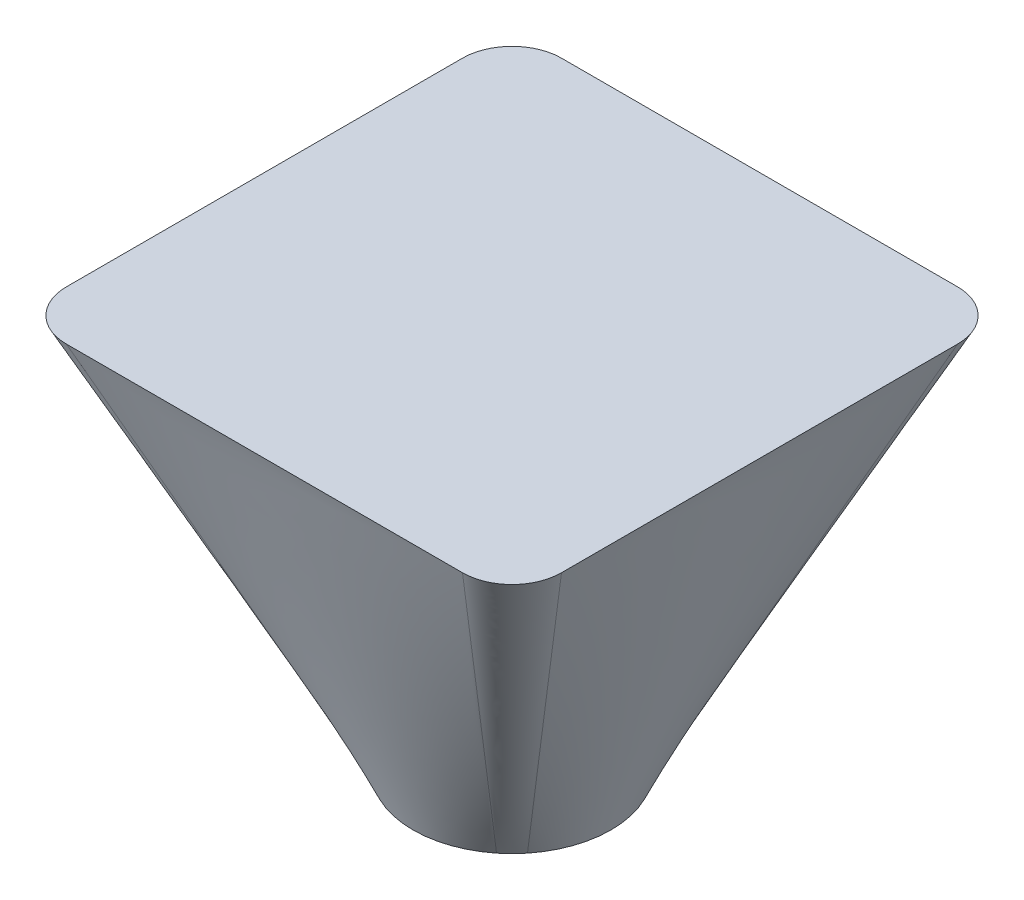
from build123d import *


with BuildPart() as part:
    # Skizze2 for Ausformung1 → Ausformung1 section 0
    with BuildSketch(Plane(origin=(0, -80, 0), x_dir=(-1, 0, 0), z_dir=(0, 1, 0))):
        with BuildLine():
            # circular arc as an exact rational Bezier (weights 1, cos(half-angle), 1)
            Bezier((-15.617376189, 12.493900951), (-25.61249695, 0), (-15.617376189, -12.493900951), weights=[1, 0.780868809, 1])
            Bezier((-15.617376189, -12.493900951), (-14.229164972, -14.229164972), (-12.493900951, -15.617376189), weights=[1, 0.993883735, 1])
            Bezier((-12.493900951, -15.617376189), (0, -25.61249695), (12.493900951, -15.617376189), weights=[1, 0.780868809, 1])
            Bezier((12.493900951, -15.617376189), (14.229164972, -14.229164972), (15.617376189, -12.493900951), weights=[1, 0.993883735, 1])
            Bezier((15.617376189, -12.493900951), (25.61249695, 0), (15.617376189, 12.493900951), weights=[1, 0.780868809, 1])
            Bezier((15.617376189, 12.493900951), (14.229164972, 14.229164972), (12.493900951, 15.617376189), weights=[1, 0.993883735, 1])
            Bezier((12.493900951, 15.617376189), (0, 25.61249695), (-12.493900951, 15.617376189), weights=[1, 0.780868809, 1])
            Bezier((-12.493900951, 15.617376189), (-14.229164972, 14.229164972), (-15.617376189, 12.493900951), weights=[1, 0.993883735, 1])
        make_face()
    # Skizze1 for Ausformung1 → Ausformung1 section 1
    with BuildSketch(Plane(origin=(0, 0, 0), x_dir=(1, 0, 0), z_dir=(0, 1, 0))):
        with BuildLine():
            Line((-40, -50), (40, -50))
            Bezier((40, -50), (50, -50), (50, -40), weights=[1, 0.707106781, 1])
            Line((50, -40), (50, 40))
            Bezier((50, 40), (50, 50), (40, 50), weights=[1, 0.707106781, 1])
            Line((40, 50), (-40, 50))
            Bezier((-40, 50), (-50, 50), (-50, 40), weights=[1, 0.707106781, 1])
            Line((-50, 40), (-50, -40))
            Bezier((-50, -40), (-50, -50), (-40, -50), weights=[1, 0.707106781, 1])
        make_face()
    loft()


solid = part.part
